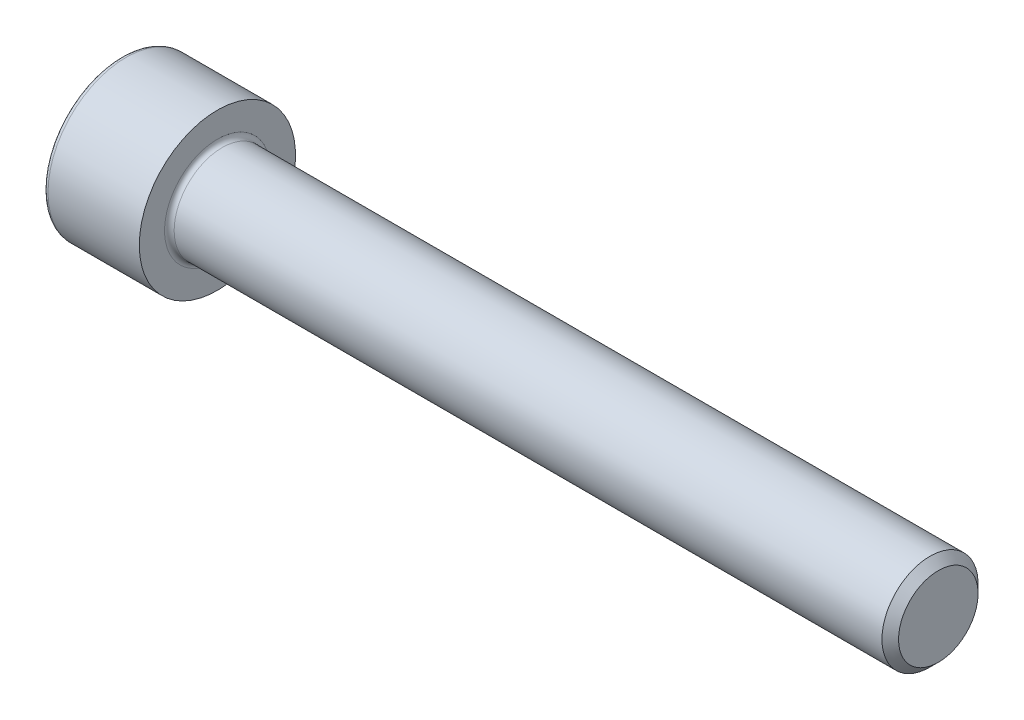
from build123d import *

# Parameters (mm, degrees)
FILLET1_R   = 0.4
FILLET2_R   = 0.4
HEX_2_DEPTH = 4


with BuildPart() as part:
    # BodySke → Base-Revolve (revolve)
    with BuildSketch(Plane.XY, mode=Mode.PRIVATE) as base_revolve_sk:
        Polygon((0, 0), (0, 6.5), (8, 6.5), (8, 4), (67.3095, 4), (68, 3.3095), (68, 0), align=None)
    revolve(base_revolve_sk.sketch.rotate(Axis((-31.75, 0, 0), (1, 0, 0)), 90), axis=Axis((-31.75, 0, 0), (1, 0, 0)))

    # Fillet1
    fillet1_edges = [part.edges().sort_by_distance(p)[0] for p in [
        (8, 0, -4),
    ]]
    fillet(fillet1_edges, radius=FILLET1_R)

    # Fillet2
    fillet2_edges = [part.edges().sort_by_distance(p)[0] for p in [
        (0, 0, -6.5),
    ]]
    fillet(fillet2_edges, radius=FILLET2_R)

    # Sketch2 → Hex-PreBroach (revolve, cut)
    with BuildSketch(Plane.XY, mode=Mode.PRIVATE) as hex_prebroach_sk:
        Polygon((0, 3.0475), (4, 3.0475), (5.759474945, 0), (0, 0), align=None)
    revolve(hex_prebroach_sk.sketch.rotate(Axis((0, 0, 0), (1, 0, 0)), 90), axis=Axis((0, 0, 0), (1, 0, 0)), mode=Mode.SUBTRACT)

    # Sketch3 → Hex 2 (cut)
    with BuildSketch(Plane(origin=(0, 0, 0), x_dir=(0, 0.500000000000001, 0.866025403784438), z_dir=(-1, 0, 0))):
        Polygon((1.759474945, 3.0475), (-1.759474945, 3.0475), (-3.518949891, 0), (-1.759474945, -3.0475), (1.759474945, -3.0475), (3.518949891, 0), align=None)
    extrude(amount=-HEX_2_DEPTH, mode=Mode.SUBTRACT)


solid = part.part
